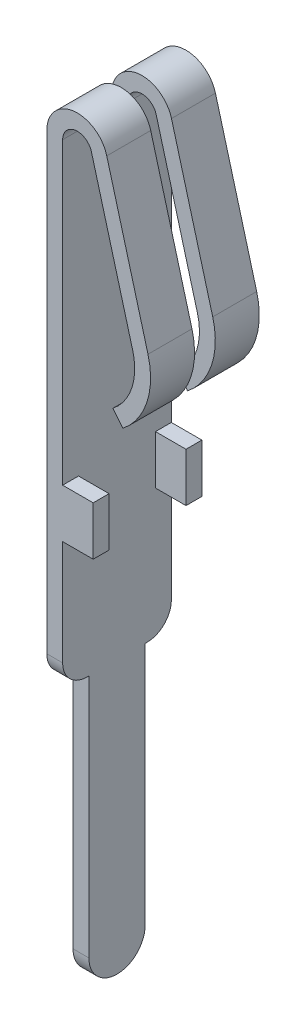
ISO-10303-21;
HEADER;
FILE_DESCRIPTION(('STEP AP214'),'2;1');
FILE_NAME('part.step','',(''),(''),'','','');
FILE_SCHEMA(('AUTOMOTIVE_DESIGN { 1 0 10303 214 1 1 1 1 }'));
ENDSEC;
DATA;
#1=APPLICATION_CONTEXT('core data for automotive mechanical design processes');
#2=APPLICATION_PROTOCOL_DEFINITION('international standard','automotive_design',2000,#1);
#3=PRODUCT_CONTEXT('',#1,'mechanical');
#4=PRODUCT('Part','Part','',(#3));
#5=PRODUCT_RELATED_PRODUCT_CATEGORY('part','',(#4));
#6=PRODUCT_DEFINITION_FORMATION('','',#4);
#7=PRODUCT_DEFINITION_CONTEXT('part definition',#1,'design');
#8=PRODUCT_DEFINITION('design','',#6,#7);
#9=PRODUCT_DEFINITION_SHAPE('','',#8);
#10=(LENGTH_UNIT() NAMED_UNIT(*) SI_UNIT(.MILLI.,.METRE.));
#11=(NAMED_UNIT(*) PLANE_ANGLE_UNIT() SI_UNIT($,.RADIAN.));
#12=(NAMED_UNIT(*) SI_UNIT($,.STERADIAN.) SOLID_ANGLE_UNIT());
#13=UNCERTAINTY_MEASURE_WITH_UNIT(LENGTH_MEASURE(1.E-05),#10,'distance_accuracy_value','');
#14=(GEOMETRIC_REPRESENTATION_CONTEXT(3) GLOBAL_UNCERTAINTY_ASSIGNED_CONTEXT((#13)) GLOBAL_UNIT_ASSIGNED_CONTEXT((#10,
#11,#12)) REPRESENTATION_CONTEXT('',''));
#15=CARTESIAN_POINT('',(0.,0.,0.));
#16=DIRECTION('',(0.,0.,1.));
#17=DIRECTION('',(1.,0.,0.));
#18=AXIS2_PLACEMENT_3D('',#15,#16,#17);
#19=CARTESIAN_POINT('',(-3.51558389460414,-2.6924,-0.6223));
#20=DIRECTION('',(0.,-1.,0.));
#21=DIRECTION('',(0.,0.,-1.));
#22=AXIS2_PLACEMENT_3D('',#19,#20,#21);
#23=PLANE('',#22);
#24=DIRECTION('',(1.,0.,0.));
#25=VECTOR('',#24,1.);
#26=CARTESIAN_POINT('',(-5.78345227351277,-2.6924,-0.5842));
#27=LINE('',#26,#25);
#28=CARTESIAN_POINT('',(0.,-2.6924,-0.5842));
#29=VERTEX_POINT('',#28);
#30=CARTESIAN_POINT('',(0.3302,-2.6924,-0.5842));
#31=VERTEX_POINT('',#30);
#32=EDGE_CURVE('E657',#29,#31,#27,.T.);
#33=ORIENTED_EDGE('',*,*,#32,.F.);
#34=DIRECTION('',(0.,0.,1.));
#35=VECTOR('',#34,1.);
#36=CARTESIAN_POINT('',(0.,-2.6924,-0.6223));
#37=LINE('',#36,#35);
#38=CARTESIAN_POINT('',(0.,-2.6924,-0.6223));
#39=VERTEX_POINT('',#38);
#40=EDGE_CURVE('E323',#39,#29,#37,.T.);
#41=ORIENTED_EDGE('',*,*,#40,.F.);
#42=DIRECTION('',(1.,0.,0.));
#43=VECTOR('',#42,1.);
#44=CARTESIAN_POINT('',(-3.51558389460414,-2.6924,-0.6223));
#45=LINE('',#44,#43);
#46=CARTESIAN_POINT('',(0.3302,-2.6924,-0.6223));
#47=VERTEX_POINT('',#46);
#48=EDGE_CURVE('E260',#39,#47,#45,.T.);
#49=ORIENTED_EDGE('',*,*,#48,.T.);
#50=DIRECTION('',(0.,0.,-1.));
#51=VECTOR('',#50,1.);
#52=CARTESIAN_POINT('',(0.3302,-2.6924,-0.6223));
#53=LINE('',#52,#51);
#54=EDGE_CURVE('E253',#31,#47,#53,.T.);
#55=ORIENTED_EDGE('',*,*,#54,.F.);
#56=EDGE_LOOP('',(#33,#41,#49,#55));
#57=FACE_BOUND('',#56,.T.);
#58=ADVANCED_FACE('F16',(#57),#23,.T.);
#59=CARTESIAN_POINT('',(0.,0.,1.1303));
#60=DIRECTION('',(0.,1.,0.));
#61=DIRECTION('',(0.,0.,1.));
#62=AXIS2_PLACEMENT_3D('',#59,#60,#61);
#63=PLANE('',#62);
#64=DIRECTION('',(0.,0.,1.));
#65=VECTOR('',#64,1.);
#66=CARTESIAN_POINT('',(0.3302,0.,1.1303));
#67=LINE('',#66,#65);
#68=CARTESIAN_POINT('',(0.3302,0.,-1.1303));
#69=VERTEX_POINT('',#68);
#70=CARTESIAN_POINT('',(0.3302,0.,-0.8001));
#71=VERTEX_POINT('',#70);
#72=EDGE_CURVE('E41',#69,#71,#67,.T.);
#73=ORIENTED_EDGE('',*,*,#72,.F.);
#74=DIRECTION('',(1.,0.,0.));
#75=VECTOR('',#74,1.);
#76=CARTESIAN_POINT('',(0.,0.,-1.1303));
#77=LINE('',#76,#75);
#78=CARTESIAN_POINT('',(0.9652,0.,-1.1303));
#79=VERTEX_POINT('',#78);
#80=EDGE_CURVE('E288',#69,#79,#77,.T.);
#81=ORIENTED_EDGE('',*,*,#80,.T.);
#82=DIRECTION('',(0.,0.,-1.));
#83=VECTOR('',#82,1.);
#84=CARTESIAN_POINT('',(0.9652,0.,-1.1303));
#85=LINE('',#84,#83);
#86=CARTESIAN_POINT('',(0.9652,0.,-0.8001));
#87=VERTEX_POINT('',#86);
#88=EDGE_CURVE('E300',#87,#79,#85,.T.);
#89=ORIENTED_EDGE('',*,*,#88,.F.);
#90=DIRECTION('',(-1.,0.,0.));
#91=VECTOR('',#90,1.);
#92=CARTESIAN_POINT('',(0.9652,0.,-0.8001));
#93=LINE('',#92,#91);
#94=EDGE_CURVE('E304',#87,#71,#93,.T.);
#95=ORIENTED_EDGE('',*,*,#94,.T.);
#96=EDGE_LOOP('',(#73,#81,#89,#95));
#97=FACE_BOUND('',#96,.T.);
#98=ADVANCED_FACE('F18',(#97),#63,.F.);
#99=CARTESIAN_POINT('',(0.3302,0.,0.8001));
#100=VERTEX_POINT('',#99);
#101=CARTESIAN_POINT('',(0.3302,0.,1.1303));
#102=VERTEX_POINT('',#101);
#103=EDGE_CURVE('E10',#100,#102,#67,.T.);
#104=ORIENTED_EDGE('',*,*,#103,.F.);
#105=DIRECTION('',(-1.,0.,0.));
#106=VECTOR('',#105,1.);
#107=CARTESIAN_POINT('',(0.9652,0.,0.8001));
#108=LINE('',#107,#106);
#109=CARTESIAN_POINT('',(0.9652,0.,0.8001));
#110=VERTEX_POINT('',#109);
#111=EDGE_CURVE('E285',#110,#100,#108,.T.);
#112=ORIENTED_EDGE('',*,*,#111,.F.);
#113=DIRECTION('',(0.,0.,-1.));
#114=VECTOR('',#113,1.);
#115=CARTESIAN_POINT('',(0.9652,0.,1.1303));
#116=LINE('',#115,#114);
#117=CARTESIAN_POINT('',(0.9652,0.,1.1303));
#118=VERTEX_POINT('',#117);
#119=EDGE_CURVE('E375',#118,#110,#116,.T.);
#120=ORIENTED_EDGE('',*,*,#119,.F.);
#121=DIRECTION('',(1.,0.,0.));
#122=VECTOR('',#121,1.);
#123=CARTESIAN_POINT('',(0.,0.,1.1303));
#124=LINE('',#123,#122);
#125=EDGE_CURVE('E279',#102,#118,#124,.T.);
#126=ORIENTED_EDGE('',*,*,#125,.F.);
#127=EDGE_LOOP('',(#104,#112,#120,#126));
#128=FACE_BOUND('',#127,.T.);
#129=ADVANCED_FACE('F514',(#128),#63,.F.);
#130=CARTESIAN_POINT('',(0.635,7.239,1.1303));
#131=DIRECTION('',(0.,0.,-1.));
#132=DIRECTION('',(-1.,0.,0.));
#133=AXIS2_PLACEMENT_3D('',#130,#131,#132);
#134=CYLINDRICAL_SURFACE('',#133,0.3048);
#135=CARTESIAN_POINT('',(0.635,7.239,-0.2159));
#136=DIRECTION('',(0.,0.,1.));
#137=DIRECTION('',(1.,0.,0.));
#138=AXIS2_PLACEMENT_3D('',#135,#136,#137);
#139=CIRCLE('',#138,0.3048);
#140=CARTESIAN_POINT('',(0.929056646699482,7.31921052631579,-0.2159));
#141=VERTEX_POINT('',#140);
#142=CARTESIAN_POINT('',(0.3302,7.239,-0.2159));
#143=VERTEX_POINT('',#142);
#144=EDGE_CURVE('E342',#141,#143,#139,.T.);
#145=ORIENTED_EDGE('',*,*,#144,.T.);
#146=DIRECTION('',(0.,0.,-1.));
#147=VECTOR('',#146,1.);
#148=CARTESIAN_POINT('',(0.3302,7.239,1.1303));
#149=LINE('',#148,#147);
#150=CARTESIAN_POINT('',(0.3302,7.239,-1.1303));
#151=VERTEX_POINT('',#150);
#152=EDGE_CURVE('E414',#143,#151,#149,.T.);
#153=ORIENTED_EDGE('',*,*,#152,.T.);
#154=CARTESIAN_POINT('',(0.635,7.239,-1.1303));
#155=DIRECTION('',(0.,0.,-1.));
#156=DIRECTION('',(-1.,0.,0.));
#157=AXIS2_PLACEMENT_3D('',#154,#155,#156);
#158=CIRCLE('',#157,0.3048);
#159=CARTESIAN_POINT('',(0.929056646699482,7.31921052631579,-1.1303));
#160=VERTEX_POINT('',#159);
#161=EDGE_CURVE('E461',#151,#160,#158,.T.);
#162=ORIENTED_EDGE('',*,*,#161,.T.);
#163=DIRECTION('',(0.,0.,-1.));
#164=VECTOR('',#163,1.);
#165=CARTESIAN_POINT('',(0.929056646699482,7.31921052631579,1.1303));
#166=LINE('',#165,#164);
#167=EDGE_CURVE('E418',#141,#160,#166,.T.);
#168=ORIENTED_EDGE('',*,*,#167,.F.);
#169=EDGE_LOOP('',(#145,#153,#162,#168));
#170=FACE_BOUND('',#169,.T.);
#171=ADVANCED_FACE('F479',(#170),#134,.F.);
#172=CARTESIAN_POINT('',(0.929056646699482,7.31921052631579,1.1303));
#173=DIRECTION('',(0.96475277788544,0.263157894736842,0.));
#174=DIRECTION('',(-0.263157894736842,0.96475277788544,0.));
#175=AXIS2_PLACEMENT_3D('',#172,#173,#174);
#176=PLANE('',#175);
#177=DIRECTION('',(0.263157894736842,-0.96475277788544,0.));
#178=VECTOR('',#177,1.);
#179=CARTESIAN_POINT('',(2.72293561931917,0.74274158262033,-0.2159));
#180=LINE('',#179,#178);
#181=CARTESIAN_POINT('',(1.78672186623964,4.17495789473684,-0.2159));
#182=VERTEX_POINT('',#181);
#183=EDGE_CURVE('E345',#141,#182,#180,.T.);
#184=ORIENTED_EDGE('',*,*,#183,.F.);
#185=ORIENTED_EDGE('',*,*,#167,.T.);
#186=DIRECTION('',(0.263157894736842,-0.96475277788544,0.));
#187=VECTOR('',#186,1.);
#188=CARTESIAN_POINT('',(0.929056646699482,7.31921052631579,-1.1303));
#189=LINE('',#188,#187);
#190=CARTESIAN_POINT('',(1.78672186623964,4.17495789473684,-1.1303));
#191=VERTEX_POINT('',#190);
#192=EDGE_CURVE('E459',#160,#191,#189,.T.);
#193=ORIENTED_EDGE('',*,*,#192,.T.);
#194=DIRECTION('',(0.,0.,-1.));
#195=VECTOR('',#194,1.);
#196=CARTESIAN_POINT('',(1.78672186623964,4.17495789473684,1.1303));
#197=LINE('',#196,#195);
#198=EDGE_CURVE('E422',#182,#191,#197,.T.);
#199=ORIENTED_EDGE('',*,*,#198,.F.);
#200=EDGE_LOOP('',(#184,#185,#193,#199));
#201=FACE_BOUND('',#200,.T.);
#202=ADVANCED_FACE('F478',(#201),#176,.F.);
#203=CARTESIAN_POINT('',(0.635,3.8608,1.1303));
#204=DIRECTION('',(0.,0.,-1.));
#205=DIRECTION('',(-1.,0.,0.));
#206=AXIS2_PLACEMENT_3D('',#203,#204,#205);
#207=CYLINDRICAL_SURFACE('',#206,1.1938);
#208=CARTESIAN_POINT('',(0.635,3.8608,-0.2159));
#209=DIRECTION('',(0.,0.,1.));
#210=DIRECTION('',(1.,0.,0.));
#211=AXIS2_PLACEMENT_3D('',#208,#209,#210);
#212=CIRCLE('',#211,1.1938);
#213=CARTESIAN_POINT('',(1.37706831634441,2.92565666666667,-0.2159));
#214=VERTEX_POINT('',#213);
#215=EDGE_CURVE('E347',#214,#182,#212,.T.);
#216=ORIENTED_EDGE('',*,*,#215,.T.);
#217=ORIENTED_EDGE('',*,*,#198,.T.);
#218=CARTESIAN_POINT('',(0.635,3.8608,-1.1303));
#219=DIRECTION('',(0.,0.,-1.));
#220=DIRECTION('',(-1.,0.,0.));
#221=AXIS2_PLACEMENT_3D('',#218,#219,#220);
#222=CIRCLE('',#221,1.1938);
#223=CARTESIAN_POINT('',(1.37706831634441,2.92565666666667,-1.1303));
#224=VERTEX_POINT('',#223);
#225=EDGE_CURVE('E456',#191,#224,#222,.T.);
#226=ORIENTED_EDGE('',*,*,#225,.T.);
#227=DIRECTION('',(0.,0.,-1.));
#228=VECTOR('',#227,1.);
#229=CARTESIAN_POINT('',(1.37706831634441,2.92565666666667,1.1303));
#230=LINE('',#229,#228);
#231=EDGE_CURVE('E426',#214,#224,#230,.T.);
#232=ORIENTED_EDGE('',*,*,#231,.F.);
#233=EDGE_LOOP('',(#216,#217,#226,#232));
#234=FACE_BOUND('',#233,.T.);
#235=ADVANCED_FACE('F568',(#234),#207,.F.);
#236=CARTESIAN_POINT('',(1.58232125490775,2.667,1.1303));
#237=DIRECTION('',(0.783333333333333,0.62160187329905,0.));
#238=DIRECTION('',(-0.62160187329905,0.783333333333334,0.));
#239=AXIS2_PLACEMENT_3D('',#236,#237,#238);
#240=PLANE('',#239);
#241=DIRECTION('',(0.621601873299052,-0.783333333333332,0.));
#242=VECTOR('',#241,1.);
#243=CARTESIAN_POINT('',(2.26954945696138,1.8009653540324,-0.2159));
#244=LINE('',#243,#242);
#245=CARTESIAN_POINT('',(1.58232125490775,2.667,-0.2159));
#246=VERTEX_POINT('',#245);
#247=EDGE_CURVE('E350',#214,#246,#244,.T.);
#248=ORIENTED_EDGE('',*,*,#247,.F.);
#249=ORIENTED_EDGE('',*,*,#231,.T.);
#250=DIRECTION('',(0.62160187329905,-0.783333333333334,0.));
#251=VECTOR('',#250,1.);
#252=CARTESIAN_POINT('',(1.58232125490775,2.667,-1.1303));
#253=LINE('',#252,#251);
#254=CARTESIAN_POINT('',(1.58232125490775,2.667,-1.1303));
#255=VERTEX_POINT('',#254);
#256=EDGE_CURVE('E453',#224,#255,#253,.T.);
#257=ORIENTED_EDGE('',*,*,#256,.T.);
#258=DIRECTION('',(0.,0.,-1.));
#259=VECTOR('',#258,1.);
#260=CARTESIAN_POINT('',(1.58232125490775,2.667,1.1303));
#261=LINE('',#260,#259);
#262=EDGE_CURVE('E430',#246,#255,#261,.T.);
#263=ORIENTED_EDGE('',*,*,#262,.F.);
#264=EDGE_LOOP('',(#248,#249,#257,#263));
#265=FACE_BOUND('',#264,.T.);
#266=ADVANCED_FACE('F557',(#265),#240,.F.);
#267=CARTESIAN_POINT('',(0.635,3.8608,1.1303));
#268=DIRECTION('',(0.,0.,-1.));
#269=DIRECTION('',(-1.,0.,0.));
#270=AXIS2_PLACEMENT_3D('',#267,#268,#269);
#271=CYLINDRICAL_SURFACE('',#270,1.524);
#272=CARTESIAN_POINT('',(0.635,3.8608,-0.2159));
#273=DIRECTION('',(0.,0.,1.));
#274=DIRECTION('',(1.,0.,0.));
#275=AXIS2_PLACEMENT_3D('',#272,#273,#274);
#276=CIRCLE('',#275,1.524);
#277=CARTESIAN_POINT('',(2.10528323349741,4.26185263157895,-0.2159));
#278=VERTEX_POINT('',#277);
#279=EDGE_CURVE('E352',#246,#278,#276,.T.);
#280=ORIENTED_EDGE('',*,*,#279,.F.);
#281=ORIENTED_EDGE('',*,*,#262,.T.);
#282=CARTESIAN_POINT('',(0.635,3.8608,-1.1303));
#283=DIRECTION('',(0.,0.,1.));
#284=DIRECTION('',(-1.,0.,0.));
#285=AXIS2_PLACEMENT_3D('',#282,#283,#284);
#286=CIRCLE('',#285,1.524);
#287=CARTESIAN_POINT('',(2.10528323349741,4.26185263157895,-1.1303));
#288=VERTEX_POINT('',#287);
#289=EDGE_CURVE('E450',#255,#288,#286,.T.);
#290=ORIENTED_EDGE('',*,*,#289,.T.);
#291=DIRECTION('',(0.,0.,-1.));
#292=VECTOR('',#291,1.);
#293=CARTESIAN_POINT('',(2.10528323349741,4.26185263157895,1.1303));
#294=LINE('',#293,#292);
#295=EDGE_CURVE('E434',#278,#288,#294,.T.);
#296=ORIENTED_EDGE('',*,*,#295,.F.);
#297=EDGE_LOOP('',(#280,#281,#290,#296));
#298=FACE_BOUND('',#297,.T.);
#299=ADVANCED_FACE('F564',(#298),#271,.T.);
#300=CARTESIAN_POINT('',(1.24761801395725,7.40610526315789,1.1303));
#301=DIRECTION('',(-0.96475277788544,-0.263157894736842,0.));
#302=DIRECTION('',(0.263157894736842,-0.96475277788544,0.));
#303=AXIS2_PLACEMENT_3D('',#300,#301,#302);
#304=PLANE('',#303);
#305=DIRECTION('',(-0.263157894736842,0.96475277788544,0.));
#306=VECTOR('',#305,1.);
#307=CARTESIAN_POINT('',(3.04149698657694,0.829636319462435,-0.2159));
#308=LINE('',#307,#306);
#309=CARTESIAN_POINT('',(1.24761801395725,7.40610526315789,-0.2159));
#310=VERTEX_POINT('',#309);
#311=EDGE_CURVE('E326',#278,#310,#308,.T.);
#312=ORIENTED_EDGE('',*,*,#311,.F.);
#313=ORIENTED_EDGE('',*,*,#295,.T.);
#314=DIRECTION('',(-0.263157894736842,0.96475277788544,0.));
#315=VECTOR('',#314,1.);
#316=CARTESIAN_POINT('',(1.24761801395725,7.40610526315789,-1.1303));
#317=LINE('',#316,#315);
#318=CARTESIAN_POINT('',(1.24761801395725,7.40610526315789,-1.1303));
#319=VERTEX_POINT('',#318);
#320=EDGE_CURVE('E447',#288,#319,#317,.T.);
#321=ORIENTED_EDGE('',*,*,#320,.T.);
#322=DIRECTION('',(0.,0.,-1.));
#323=VECTOR('',#322,1.);
#324=CARTESIAN_POINT('',(1.24761801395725,7.40610526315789,1.1303));
#325=LINE('',#324,#323);
#326=EDGE_CURVE('E438',#310,#319,#325,.T.);
#327=ORIENTED_EDGE('',*,*,#326,.F.);
#328=EDGE_LOOP('',(#312,#313,#321,#327));
#329=FACE_BOUND('',#328,.T.);
#330=ADVANCED_FACE('F629',(#329),#304,.F.);
#331=CARTESIAN_POINT('',(0.635,7.239,1.1303));
#332=DIRECTION('',(0.,0.,-1.));
#333=DIRECTION('',(-1.,0.,0.));
#334=AXIS2_PLACEMENT_3D('',#331,#332,#333);
#335=CYLINDRICAL_SURFACE('',#334,0.635);
#336=CARTESIAN_POINT('',(0.635,7.239,-0.2159));
#337=DIRECTION('',(0.,0.,1.));
#338=DIRECTION('',(1.,0.,0.));
#339=AXIS2_PLACEMENT_3D('',#336,#337,#338);
#340=CIRCLE('',#339,0.635);
#341=CARTESIAN_POINT('',(0.,7.239,-0.2159));
#342=VERTEX_POINT('',#341);
#343=EDGE_CURVE('E329',#310,#342,#340,.T.);
#344=ORIENTED_EDGE('',*,*,#343,.F.);
#345=ORIENTED_EDGE('',*,*,#326,.T.);
#346=CARTESIAN_POINT('',(0.635,7.239,-1.1303));
#347=DIRECTION('',(0.,0.,1.));
#348=DIRECTION('',(-1.,0.,0.));
#349=AXIS2_PLACEMENT_3D('',#346,#347,#348);
#350=CIRCLE('',#349,0.635);
#351=CARTESIAN_POINT('',(0.,7.239,-1.1303));
#352=VERTEX_POINT('',#351);
#353=EDGE_CURVE('E444',#319,#352,#350,.T.);
#354=ORIENTED_EDGE('',*,*,#353,.T.);
#355=DIRECTION('',(0.,0.,-1.));
#356=VECTOR('',#355,1.);
#357=CARTESIAN_POINT('',(0.,7.239,1.1303));
#358=LINE('',#357,#356);
#359=EDGE_CURVE('E406',#342,#352,#358,.T.);
#360=ORIENTED_EDGE('',*,*,#359,.F.);
#361=EDGE_LOOP('',(#344,#345,#354,#360));
#362=FACE_BOUND('',#361,.T.);
#363=ADVANCED_FACE('F627',(#362),#335,.T.);
#364=CARTESIAN_POINT('',(0.3302,0.,1.1303));
#365=DIRECTION('',(-1.,0.,0.));
#366=DIRECTION('',(0.,0.,1.));
#367=AXIS2_PLACEMENT_3D('',#364,#365,#366);
#368=PLANE('',#367);
#369=DIRECTION('',(0.,0.,1.));
#370=VECTOR('',#369,1.);
#371=CARTESIAN_POINT('',(0.3302,1.016,-1.1303));
#372=LINE('',#371,#370);
#373=CARTESIAN_POINT('',(0.3302,1.016,-1.1303));
#374=VERTEX_POINT('',#373);
#375=CARTESIAN_POINT('',(0.3302,1.016,-0.8001));
#376=VERTEX_POINT('',#375);
#377=EDGE_CURVE('E301',#374,#376,#372,.T.);
#378=ORIENTED_EDGE('',*,*,#377,.F.);
#379=DIRECTION('',(0.,1.,0.));
#380=VECTOR('',#379,1.);
#381=CARTESIAN_POINT('',(0.3302,0.,-1.1303));
#382=LINE('',#381,#380);
#383=EDGE_CURVE('E409',#374,#151,#382,.T.);
#384=ORIENTED_EDGE('',*,*,#383,.T.);
#385=ORIENTED_EDGE('',*,*,#152,.F.);
#386=DIRECTION('',(0.,0.,-1.));
#387=VECTOR('',#386,1.);
#388=CARTESIAN_POINT('',(0.3302,7.239,0.2159));
#389=LINE('',#388,#387);
#390=CARTESIAN_POINT('',(0.3302,7.239,0.2159));
#391=VERTEX_POINT('',#390);
#392=EDGE_CURVE('E354',#391,#143,#389,.T.);
#393=ORIENTED_EDGE('',*,*,#392,.F.);
#394=CARTESIAN_POINT('',(0.3302,7.239,1.1303));
#395=VERTEX_POINT('',#394);
#396=EDGE_CURVE('E25',#395,#391,#149,.T.);
#397=ORIENTED_EDGE('',*,*,#396,.F.);
#398=DIRECTION('',(0.,1.,0.));
#399=VECTOR('',#398,1.);
#400=CARTESIAN_POINT('',(0.3302,0.,1.1303));
#401=LINE('',#400,#399);
#402=CARTESIAN_POINT('',(0.3302,1.016,1.1303));
#403=VERTEX_POINT('',#402);
#404=EDGE_CURVE('E388',#403,#395,#401,.T.);
#405=ORIENTED_EDGE('',*,*,#404,.F.);
#406=DIRECTION('',(0.,0.,1.));
#407=VECTOR('',#406,1.);
#408=CARTESIAN_POINT('',(0.3302,1.016,1.1303));
#409=LINE('',#408,#407);
#410=CARTESIAN_POINT('',(0.3302,1.016,0.8001));
#411=VERTEX_POINT('',#410);
#412=EDGE_CURVE('E294',#411,#403,#409,.T.);
#413=ORIENTED_EDGE('',*,*,#412,.F.);
#414=DIRECTION('',(0.,1.,0.));
#415=VECTOR('',#414,1.);
#416=CARTESIAN_POINT('',(0.3302,0.,0.8001));
#417=LINE('',#416,#415);
#418=EDGE_CURVE('E292',#100,#411,#417,.T.);
#419=ORIENTED_EDGE('',*,*,#418,.F.);
#420=ORIENTED_EDGE('',*,*,#103,.T.);
#421=DIRECTION('',(0.,-1.,0.));
#422=VECTOR('',#421,1.);
#423=CARTESIAN_POINT('',(0.3302,0.,1.1303));
#424=LINE('',#423,#422);
#425=CARTESIAN_POINT('',(0.3302,-2.1844,1.1303));
#426=VERTEX_POINT('',#425);
#427=EDGE_CURVE('E268',#102,#426,#424,.T.);
#428=ORIENTED_EDGE('',*,*,#427,.T.);
#429=CARTESIAN_POINT('',(0.3302,-2.1844,0.6223));
#430=DIRECTION('',(1.,0.,0.));
#431=DIRECTION('',(0.,0.,-1.));
#432=AXIS2_PLACEMENT_3D('',#429,#430,#431);
#433=CIRCLE('',#432,0.508);
#434=CARTESIAN_POINT('',(0.3302,-2.6924,0.6223));
#435=VERTEX_POINT('',#434);
#436=EDGE_CURVE('E251',#426,#435,#433,.T.);
#437=ORIENTED_EDGE('',*,*,#436,.T.);
#438=CARTESIAN_POINT('',(0.3302,-2.6924,0.5842));
#439=VERTEX_POINT('',#438);
#440=EDGE_CURVE('E242',#435,#439,#53,.T.);
#441=ORIENTED_EDGE('',*,*,#440,.T.);
#442=DIRECTION('',(0.,-1.,0.));
#443=VECTOR('',#442,1.);
#444=CARTESIAN_POINT('',(0.3302,-2.6924,0.5842));
#445=LINE('',#444,#443);
#446=CARTESIAN_POINT('',(0.3302,-7.7724,0.584199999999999));
#447=VERTEX_POINT('',#446);
#448=EDGE_CURVE('E227',#439,#447,#445,.T.);
#449=ORIENTED_EDGE('',*,*,#448,.T.);
#450=CARTESIAN_POINT('',(0.3302,-7.7724,0.));
#451=DIRECTION('',(1.,0.,0.));
#452=DIRECTION('',(0.,0.,1.));
#453=AXIS2_PLACEMENT_3D('',#450,#451,#452);
#454=CIRCLE('',#453,0.5842);
#455=CARTESIAN_POINT('',(0.3302,-7.7724,-0.584200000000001));
#456=VERTEX_POINT('',#455);
#457=EDGE_CURVE('E235',#447,#456,#454,.T.);
#458=ORIENTED_EDGE('',*,*,#457,.T.);
#459=DIRECTION('',(0.,1.,0.));
#460=VECTOR('',#459,1.);
#461=CARTESIAN_POINT('',(0.3302,-2.6924,-0.5842));
#462=LINE('',#461,#460);
#463=EDGE_CURVE('E244',#456,#31,#462,.T.);
#464=ORIENTED_EDGE('',*,*,#463,.T.);
#465=ORIENTED_EDGE('',*,*,#54,.T.);
#466=CARTESIAN_POINT('',(0.3302,-2.1844,-0.6223));
#467=DIRECTION('',(1.,0.,0.));
#468=DIRECTION('',(0.,0.,1.));
#469=AXIS2_PLACEMENT_3D('',#466,#467,#468);
#470=CIRCLE('',#469,0.508);
#471=CARTESIAN_POINT('',(0.3302,-2.1844,-1.1303));
#472=VERTEX_POINT('',#471);
#473=EDGE_CURVE('E274',#47,#472,#470,.T.);
#474=ORIENTED_EDGE('',*,*,#473,.T.);
#475=DIRECTION('',(0.,1.,0.));
#476=VECTOR('',#475,1.);
#477=CARTESIAN_POINT('',(0.3302,0.,-1.1303));
#478=LINE('',#477,#476);
#479=EDGE_CURVE('E269',#472,#69,#478,.T.);
#480=ORIENTED_EDGE('',*,*,#479,.T.);
#481=ORIENTED_EDGE('',*,*,#72,.T.);
#482=DIRECTION('',(0.,-1.,0.));
#483=VECTOR('',#482,1.);
#484=CARTESIAN_POINT('',(0.3302,0.,-0.8001));
#485=LINE('',#484,#483);
#486=EDGE_CURVE('E298',#376,#71,#485,.T.);
#487=ORIENTED_EDGE('',*,*,#486,.F.);
#488=EDGE_LOOP('',(#378,#384,#385,#393,#397,#405,#413,#419,#420,#428,#437,#441,#449,#458,#464,
#465,#474,#480,#481,#487));
#489=FACE_BOUND('',#488,.T.);
#490=ADVANCED_FACE('F248',(#489),#368,.F.);
#491=ORIENTED_EDGE('',*,*,#396,.T.);
#492=CARTESIAN_POINT('',(0.635,7.239,0.2159));
#493=DIRECTION('',(0.,0.,1.));
#494=DIRECTION('',(1.,0.,0.));
#495=AXIS2_PLACEMENT_3D('',#492,#493,#494);
#496=CIRCLE('',#495,0.3048);
#497=CARTESIAN_POINT('',(0.929056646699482,7.31921052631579,0.2159));
#498=VERTEX_POINT('',#497);
#499=EDGE_CURVE('E495',#498,#391,#496,.T.);
#500=ORIENTED_EDGE('',*,*,#499,.F.);
#501=CARTESIAN_POINT('',(0.929056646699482,7.31921052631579,1.1303));
#502=VERTEX_POINT('',#501);
#503=EDGE_CURVE('E415',#502,#498,#166,.T.);
#504=ORIENTED_EDGE('',*,*,#503,.F.);
#505=CARTESIAN_POINT('',(0.635,7.239,1.1303));
#506=DIRECTION('',(0.,0.,-1.));
#507=DIRECTION('',(-1.,0.,0.));
#508=AXIS2_PLACEMENT_3D('',#505,#506,#507);
#509=CIRCLE('',#508,0.3048);
#510=EDGE_CURVE('E390',#395,#502,#509,.T.);
#511=ORIENTED_EDGE('',*,*,#510,.F.);
#512=EDGE_LOOP('',(#491,#500,#504,#511));
#513=FACE_BOUND('',#512,.T.);
#514=ADVANCED_FACE('F493',(#513),#134,.F.);
#515=ORIENTED_EDGE('',*,*,#503,.T.);
#516=DIRECTION('',(0.263157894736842,-0.96475277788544,0.));
#517=VECTOR('',#516,1.);
#518=CARTESIAN_POINT('',(2.72293561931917,0.74274158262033,0.2159));
#519=LINE('',#518,#517);
#520=CARTESIAN_POINT('',(1.78672186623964,4.17495789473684,0.2159));
#521=VERTEX_POINT('',#520);
#522=EDGE_CURVE('E534',#498,#521,#519,.T.);
#523=ORIENTED_EDGE('',*,*,#522,.T.);
#524=CARTESIAN_POINT('',(1.78672186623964,4.17495789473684,1.1303));
#525=VERTEX_POINT('',#524);
#526=EDGE_CURVE('E419',#525,#521,#197,.T.);
#527=ORIENTED_EDGE('',*,*,#526,.F.);
#528=DIRECTION('',(0.263157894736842,-0.96475277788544,0.));
#529=VECTOR('',#528,1.);
#530=CARTESIAN_POINT('',(0.929056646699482,7.31921052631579,1.1303));
#531=LINE('',#530,#529);
#532=EDGE_CURVE('E392',#502,#525,#531,.T.);
#533=ORIENTED_EDGE('',*,*,#532,.F.);
#534=EDGE_LOOP('',(#515,#523,#527,#533));
#535=FACE_BOUND('',#534,.T.);
#536=ADVANCED_FACE('F565',(#535),#176,.F.);
#537=ORIENTED_EDGE('',*,*,#526,.T.);
#538=CARTESIAN_POINT('',(0.635,3.8608,0.2159));
#539=DIRECTION('',(0.,0.,1.));
#540=DIRECTION('',(1.,0.,0.));
#541=AXIS2_PLACEMENT_3D('',#538,#539,#540);
#542=CIRCLE('',#541,1.1938);
#543=CARTESIAN_POINT('',(1.37706831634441,2.92565666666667,0.2159));
#544=VERTEX_POINT('',#543);
#545=EDGE_CURVE('E537',#544,#521,#542,.T.);
#546=ORIENTED_EDGE('',*,*,#545,.F.);
#547=CARTESIAN_POINT('',(1.37706831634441,2.92565666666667,1.1303));
#548=VERTEX_POINT('',#547);
#549=EDGE_CURVE('E423',#548,#544,#230,.T.);
#550=ORIENTED_EDGE('',*,*,#549,.F.);
#551=CARTESIAN_POINT('',(0.635,3.8608,1.1303));
#552=DIRECTION('',(0.,0.,-1.));
#553=DIRECTION('',(-1.,0.,0.));
#554=AXIS2_PLACEMENT_3D('',#551,#552,#553);
#555=CIRCLE('',#554,1.1938);
#556=EDGE_CURVE('E394',#525,#548,#555,.T.);
#557=ORIENTED_EDGE('',*,*,#556,.F.);
#558=EDGE_LOOP('',(#537,#546,#550,#557));
#559=FACE_BOUND('',#558,.T.);
#560=ADVANCED_FACE('F555',(#559),#207,.F.);
#561=ORIENTED_EDGE('',*,*,#549,.T.);
#562=DIRECTION('',(0.621601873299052,-0.783333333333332,0.));
#563=VECTOR('',#562,1.);
#564=CARTESIAN_POINT('',(2.26954945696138,1.8009653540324,0.2159));
#565=LINE('',#564,#563);
#566=CARTESIAN_POINT('',(1.58232125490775,2.667,0.2159));
#567=VERTEX_POINT('',#566);
#568=EDGE_CURVE('E538',#544,#567,#565,.T.);
#569=ORIENTED_EDGE('',*,*,#568,.T.);
#570=CARTESIAN_POINT('',(1.58232125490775,2.667,1.1303));
#571=VERTEX_POINT('',#570);
#572=EDGE_CURVE('E427',#571,#567,#261,.T.);
#573=ORIENTED_EDGE('',*,*,#572,.F.);
#574=DIRECTION('',(0.62160187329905,-0.783333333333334,0.));
#575=VECTOR('',#574,1.);
#576=CARTESIAN_POINT('',(1.58232125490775,2.667,1.1303));
#577=LINE('',#576,#575);
#578=EDGE_CURVE('E396',#548,#571,#577,.T.);
#579=ORIENTED_EDGE('',*,*,#578,.F.);
#580=EDGE_LOOP('',(#561,#569,#573,#579));
#581=FACE_BOUND('',#580,.T.);
#582=ADVANCED_FACE('F553',(#581),#240,.F.);
#583=ORIENTED_EDGE('',*,*,#572,.T.);
#584=CARTESIAN_POINT('',(0.635,3.8608,0.2159));
#585=DIRECTION('',(0.,0.,1.));
#586=DIRECTION('',(1.,0.,0.));
#587=AXIS2_PLACEMENT_3D('',#584,#585,#586);
#588=CIRCLE('',#587,1.524);
#589=CARTESIAN_POINT('',(2.10528323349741,4.26185263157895,0.2159));
#590=VERTEX_POINT('',#589);
#591=EDGE_CURVE('E338',#567,#590,#588,.T.);
#592=ORIENTED_EDGE('',*,*,#591,.T.);
#593=CARTESIAN_POINT('',(2.10528323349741,4.26185263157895,1.1303));
#594=VERTEX_POINT('',#593);
#595=EDGE_CURVE('E431',#594,#590,#294,.T.);
#596=ORIENTED_EDGE('',*,*,#595,.F.);
#597=CARTESIAN_POINT('',(0.635,3.8608,1.1303));
#598=DIRECTION('',(0.,0.,1.));
#599=DIRECTION('',(-1.,0.,0.));
#600=AXIS2_PLACEMENT_3D('',#597,#598,#599);
#601=CIRCLE('',#600,1.524);
#602=EDGE_CURVE('E398',#571,#594,#601,.T.);
#603=ORIENTED_EDGE('',*,*,#602,.F.);
#604=EDGE_LOOP('',(#583,#592,#596,#603));
#605=FACE_BOUND('',#604,.T.);
#606=ADVANCED_FACE('F545',(#605),#271,.T.);
#607=ORIENTED_EDGE('',*,*,#595,.T.);
#608=DIRECTION('',(-0.263157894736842,0.96475277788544,0.));
#609=VECTOR('',#608,1.);
#610=CARTESIAN_POINT('',(3.04149698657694,0.829636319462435,0.2159));
#611=LINE('',#610,#609);
#612=CARTESIAN_POINT('',(1.24761801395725,7.40610526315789,0.2159));
#613=VERTEX_POINT('',#612);
#614=EDGE_CURVE('E270',#590,#613,#611,.T.);
#615=ORIENTED_EDGE('',*,*,#614,.T.);
#616=CARTESIAN_POINT('',(1.24761801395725,7.40610526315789,1.1303));
#617=VERTEX_POINT('',#616);
#618=EDGE_CURVE('E435',#617,#613,#325,.T.);
#619=ORIENTED_EDGE('',*,*,#618,.F.);
#620=DIRECTION('',(-0.263157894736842,0.96475277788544,0.));
#621=VECTOR('',#620,1.);
#622=CARTESIAN_POINT('',(1.24761801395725,7.40610526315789,1.1303));
#623=LINE('',#622,#621);
#624=EDGE_CURVE('E400',#594,#617,#623,.T.);
#625=ORIENTED_EDGE('',*,*,#624,.F.);
#626=EDGE_LOOP('',(#607,#615,#619,#625));
#627=FACE_BOUND('',#626,.T.);
#628=ADVANCED_FACE('F549',(#627),#304,.F.);
#629=ORIENTED_EDGE('',*,*,#618,.T.);
#630=CARTESIAN_POINT('',(0.635,7.239,0.2159));
#631=DIRECTION('',(0.,0.,1.));
#632=DIRECTION('',(1.,0.,0.));
#633=AXIS2_PLACEMENT_3D('',#630,#631,#632);
#634=CIRCLE('',#633,0.635);
#635=CARTESIAN_POINT('',(0.,7.239,0.2159));
#636=VERTEX_POINT('',#635);
#637=EDGE_CURVE('E527',#613,#636,#634,.T.);
#638=ORIENTED_EDGE('',*,*,#637,.T.);
#639=CARTESIAN_POINT('',(0.,7.239,1.1303));
#640=VERTEX_POINT('',#639);
#641=EDGE_CURVE('E439',#640,#636,#358,.T.);
#642=ORIENTED_EDGE('',*,*,#641,.F.);
#643=CARTESIAN_POINT('',(0.635,7.239,1.1303));
#644=DIRECTION('',(0.,0.,1.));
#645=DIRECTION('',(-1.,0.,0.));
#646=AXIS2_PLACEMENT_3D('',#643,#644,#645);
#647=CIRCLE('',#646,0.635);
#648=EDGE_CURVE('E402',#617,#640,#647,.T.);
#649=ORIENTED_EDGE('',*,*,#648,.F.);
#650=EDGE_LOOP('',(#629,#638,#642,#649));
#651=FACE_BOUND('',#650,.T.);
#652=ADVANCED_FACE('F526',(#651),#335,.T.);
#653=CARTESIAN_POINT('',(0.,0.,1.1303));
#654=DIRECTION('',(1.,0.,0.));
#655=DIRECTION('',(0.,0.,-1.));
#656=AXIS2_PLACEMENT_3D('',#653,#654,#655);
#657=PLANE('',#656);
#658=DIRECTION('',(0.,-1.,0.));
#659=VECTOR('',#658,1.);
#660=CARTESIAN_POINT('',(0.,0.,-1.1303));
#661=LINE('',#660,#659);
#662=CARTESIAN_POINT('',(0.,-2.1844,-1.1303));
#663=VERTEX_POINT('',#662);
#664=EDGE_CURVE('E442',#352,#663,#661,.T.);
#665=ORIENTED_EDGE('',*,*,#664,.T.);
#666=CARTESIAN_POINT('',(0.,-2.1844,-0.6223));
#667=DIRECTION('',(1.,0.,0.));
#668=DIRECTION('',(0.,0.,-1.));
#669=AXIS2_PLACEMENT_3D('',#666,#667,#668);
#670=CIRCLE('',#669,0.508);
#671=EDGE_CURVE('E325',#663,#39,#670,.F.);
#672=ORIENTED_EDGE('',*,*,#671,.T.);
#673=ORIENTED_EDGE('',*,*,#40,.T.);
#674=DIRECTION('',(0.,-1.,0.));
#675=VECTOR('',#674,1.);
#676=CARTESIAN_POINT('',(0.,-2.6924,-0.5842));
#677=LINE('',#676,#675);
#678=CARTESIAN_POINT('',(0.,-7.7724,-0.584200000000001));
#679=VERTEX_POINT('',#678);
#680=EDGE_CURVE('E314',#29,#679,#677,.T.);
#681=ORIENTED_EDGE('',*,*,#680,.T.);
#682=CARTESIAN_POINT('',(0.,-7.7724,0.));
#683=DIRECTION('',(1.,0.,0.));
#684=DIRECTION('',(0.,0.,-1.));
#685=AXIS2_PLACEMENT_3D('',#682,#683,#684);
#686=CIRCLE('',#685,0.5842);
#687=CARTESIAN_POINT('',(0.,-7.7724,0.584199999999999));
#688=VERTEX_POINT('',#687);
#689=EDGE_CURVE('E317',#679,#688,#686,.F.);
#690=ORIENTED_EDGE('',*,*,#689,.T.);
#691=DIRECTION('',(0.,1.,0.));
#692=VECTOR('',#691,1.);
#693=CARTESIAN_POINT('',(0.,-2.6924,0.5842));
#694=LINE('',#693,#692);
#695=CARTESIAN_POINT('',(0.,-2.6924,0.5842));
#696=VERTEX_POINT('',#695);
#697=EDGE_CURVE('E312',#688,#696,#694,.T.);
#698=ORIENTED_EDGE('',*,*,#697,.T.);
#699=CARTESIAN_POINT('',(0.,-2.6924,0.6223));
#700=VERTEX_POINT('',#699);
#701=EDGE_CURVE('E243',#696,#700,#37,.T.);
#702=ORIENTED_EDGE('',*,*,#701,.T.);
#703=CARTESIAN_POINT('',(0.,-2.1844,0.6223));
#704=DIRECTION('',(1.,0.,0.));
#705=DIRECTION('',(0.,0.,-1.));
#706=AXIS2_PLACEMENT_3D('',#703,#704,#705);
#707=CIRCLE('',#706,0.508);
#708=CARTESIAN_POINT('',(0.,-2.1844,1.1303));
#709=VERTEX_POINT('',#708);
#710=EDGE_CURVE('E263',#700,#709,#707,.F.);
#711=ORIENTED_EDGE('',*,*,#710,.T.);
#712=DIRECTION('',(0.,-1.,0.));
#713=VECTOR('',#712,1.);
#714=CARTESIAN_POINT('',(0.,0.,1.1303));
#715=LINE('',#714,#713);
#716=EDGE_CURVE('E404',#640,#709,#715,.T.);
#717=ORIENTED_EDGE('',*,*,#716,.F.);
#718=ORIENTED_EDGE('',*,*,#641,.T.);
#719=DIRECTION('',(0.,0.,-1.));
#720=VECTOR('',#719,1.);
#721=CARTESIAN_POINT('',(0.,7.239,0.2159));
#722=LINE('',#721,#720);
#723=EDGE_CURVE('E356',#636,#342,#722,.T.);
#724=ORIENTED_EDGE('',*,*,#723,.T.);
#725=ORIENTED_EDGE('',*,*,#359,.T.);
#726=EDGE_LOOP('',(#665,#672,#673,#681,#690,#698,#702,#711,#717,#718,#724,#725));
#727=FACE_BOUND('',#726,.T.);
#728=ADVANCED_FACE('F521',(#727),#657,.F.);
#729=CARTESIAN_POINT('',(0.635,7.239,1.1303));
#730=DIRECTION('',(0.,0.,-1.));
#731=DIRECTION('',(-1.,0.,0.));
#732=AXIS2_PLACEMENT_3D('',#729,#730,#731);
#733=PLANE('',#732);
#734=ORIENTED_EDGE('',*,*,#716,.T.);
#735=DIRECTION('',(1.,0.,0.));
#736=VECTOR('',#735,1.);
#737=CARTESIAN_POINT('',(-3.51558389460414,-2.1844,1.1303));
#738=LINE('',#737,#736);
#739=EDGE_CURVE('E255',#709,#426,#738,.T.);
#740=ORIENTED_EDGE('',*,*,#739,.T.);
#741=ORIENTED_EDGE('',*,*,#427,.F.);
#742=ORIENTED_EDGE('',*,*,#125,.T.);
#743=DIRECTION('',(0.,-1.,0.));
#744=VECTOR('',#743,1.);
#745=CARTESIAN_POINT('',(0.9652,0.,1.1303));
#746=LINE('',#745,#744);
#747=CARTESIAN_POINT('',(0.9652,1.016,1.1303));
#748=VERTEX_POINT('',#747);
#749=EDGE_CURVE('E372',#748,#118,#746,.T.);
#750=ORIENTED_EDGE('',*,*,#749,.F.);
#751=DIRECTION('',(-1.,0.,0.));
#752=VECTOR('',#751,1.);
#753=CARTESIAN_POINT('',(0.9652,1.016,1.1303));
#754=LINE('',#753,#752);
#755=EDGE_CURVE('E381',#748,#403,#754,.T.);
#756=ORIENTED_EDGE('',*,*,#755,.T.);
#757=ORIENTED_EDGE('',*,*,#404,.T.);
#758=ORIENTED_EDGE('',*,*,#510,.T.);
#759=ORIENTED_EDGE('',*,*,#532,.T.);
#760=ORIENTED_EDGE('',*,*,#556,.T.);
#761=ORIENTED_EDGE('',*,*,#578,.T.);
#762=ORIENTED_EDGE('',*,*,#602,.T.);
#763=ORIENTED_EDGE('',*,*,#624,.T.);
#764=ORIENTED_EDGE('',*,*,#648,.T.);
#765=EDGE_LOOP('',(#734,#740,#741,#742,#750,#756,#757,#758,#759,#760,#761,#762,#763,#764));
#766=FACE_BOUND('',#765,.T.);
#767=ADVANCED_FACE('F498',(#766),#733,.F.);
#768=CARTESIAN_POINT('',(0.635,7.239,-1.1303));
#769=DIRECTION('',(0.,0.,-1.));
#770=DIRECTION('',(-1.,0.,0.));
#771=AXIS2_PLACEMENT_3D('',#768,#769,#770);
#772=PLANE('',#771);
#773=ORIENTED_EDGE('',*,*,#80,.F.);
#774=ORIENTED_EDGE('',*,*,#479,.F.);
#775=DIRECTION('',(1.,0.,0.));
#776=VECTOR('',#775,1.);
#777=CARTESIAN_POINT('',(-3.51558389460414,-2.1844,-1.1303));
#778=LINE('',#777,#776);
#779=EDGE_CURVE('E252',#663,#472,#778,.T.);
#780=ORIENTED_EDGE('',*,*,#779,.F.);
#781=ORIENTED_EDGE('',*,*,#664,.F.);
#782=ORIENTED_EDGE('',*,*,#353,.F.);
#783=ORIENTED_EDGE('',*,*,#320,.F.);
#784=ORIENTED_EDGE('',*,*,#289,.F.);
#785=ORIENTED_EDGE('',*,*,#256,.F.);
#786=ORIENTED_EDGE('',*,*,#225,.F.);
#787=ORIENTED_EDGE('',*,*,#192,.F.);
#788=ORIENTED_EDGE('',*,*,#161,.F.);
#789=ORIENTED_EDGE('',*,*,#383,.F.);
#790=DIRECTION('',(-1.,0.,0.));
#791=VECTOR('',#790,1.);
#792=CARTESIAN_POINT('',(0.9652,1.016,-1.1303));
#793=LINE('',#792,#791);
#794=CARTESIAN_POINT('',(0.9652,1.016,-1.1303));
#795=VERTEX_POINT('',#794);
#796=EDGE_CURVE('E295',#795,#374,#793,.T.);
#797=ORIENTED_EDGE('',*,*,#796,.F.);
#798=DIRECTION('',(0.,1.,0.));
#799=VECTOR('',#798,1.);
#800=CARTESIAN_POINT('',(0.9652,0.,-1.1303));
#801=LINE('',#800,#799);
#802=EDGE_CURVE('E361',#79,#795,#801,.T.);
#803=ORIENTED_EDGE('',*,*,#802,.F.);
#804=EDGE_LOOP('',(#773,#774,#780,#781,#782,#783,#784,#785,#786,#787,#788,#789,#797,#803));
#805=FACE_BOUND('',#804,.T.);
#806=ADVANCED_FACE('F472',(#805),#772,.T.);
#807=CARTESIAN_POINT('',(0.9652,0.,0.8001));
#808=DIRECTION('',(0.,0.,1.));
#809=DIRECTION('',(1.,0.,0.));
#810=AXIS2_PLACEMENT_3D('',#807,#808,#809);
#811=PLANE('',#810);
#812=ORIENTED_EDGE('',*,*,#418,.T.);
#813=DIRECTION('',(-1.,0.,0.));
#814=VECTOR('',#813,1.);
#815=CARTESIAN_POINT('',(0.9652,1.016,0.8001));
#816=LINE('',#815,#814);
#817=CARTESIAN_POINT('',(0.9652,1.016,0.8001));
#818=VERTEX_POINT('',#817);
#819=EDGE_CURVE('E289',#818,#411,#816,.T.);
#820=ORIENTED_EDGE('',*,*,#819,.F.);
#821=DIRECTION('',(0.,1.,0.));
#822=VECTOR('',#821,1.);
#823=CARTESIAN_POINT('',(0.9652,0.,0.8001));
#824=LINE('',#823,#822);
#825=EDGE_CURVE('E377',#110,#818,#824,.T.);
#826=ORIENTED_EDGE('',*,*,#825,.F.);
#827=ORIENTED_EDGE('',*,*,#111,.T.);
#828=EDGE_LOOP('',(#812,#820,#826,#827));
#829=FACE_BOUND('',#828,.T.);
#830=ADVANCED_FACE('F510',(#829),#811,.F.);
#831=CARTESIAN_POINT('',(0.9652,1.016,1.1303));
#832=DIRECTION('',(0.,-1.,0.));
#833=DIRECTION('',(0.,0.,-1.));
#834=AXIS2_PLACEMENT_3D('',#831,#832,#833);
#835=PLANE('',#834);
#836=ORIENTED_EDGE('',*,*,#412,.T.);
#837=ORIENTED_EDGE('',*,*,#755,.F.);
#838=DIRECTION('',(0.,0.,1.));
#839=VECTOR('',#838,1.);
#840=CARTESIAN_POINT('',(0.9652,1.016,1.1303));
#841=LINE('',#840,#839);
#842=EDGE_CURVE('E379',#818,#748,#841,.T.);
#843=ORIENTED_EDGE('',*,*,#842,.F.);
#844=ORIENTED_EDGE('',*,*,#819,.T.);
#845=EDGE_LOOP('',(#836,#837,#843,#844));
#846=FACE_BOUND('',#845,.T.);
#847=ADVANCED_FACE('F505',(#846),#835,.F.);
#848=CARTESIAN_POINT('',(0.9652,1.016,1.1303));
#849=DIRECTION('',(-1.,0.,0.));
#850=DIRECTION('',(0.,0.,1.));
#851=AXIS2_PLACEMENT_3D('',#848,#849,#850);
#852=PLANE('',#851);
#853=ORIENTED_EDGE('',*,*,#749,.T.);
#854=ORIENTED_EDGE('',*,*,#119,.T.);
#855=ORIENTED_EDGE('',*,*,#825,.T.);
#856=ORIENTED_EDGE('',*,*,#842,.T.);
#857=EDGE_LOOP('',(#853,#854,#855,#856));
#858=FACE_BOUND('',#857,.T.);
#859=ADVANCED_FACE('F610',(#858),#852,.F.);
#860=CARTESIAN_POINT('',(0.9652,1.016,-1.1303));
#861=DIRECTION('',(0.,-1.,0.));
#862=DIRECTION('',(0.,0.,-1.));
#863=AXIS2_PLACEMENT_3D('',#860,#861,#862);
#864=PLANE('',#863);
#865=ORIENTED_EDGE('',*,*,#377,.T.);
#866=DIRECTION('',(-1.,0.,0.));
#867=VECTOR('',#866,1.);
#868=CARTESIAN_POINT('',(0.9652,1.016,-0.8001));
#869=LINE('',#868,#867);
#870=CARTESIAN_POINT('',(0.9652,1.016,-0.8001));
#871=VERTEX_POINT('',#870);
#872=EDGE_CURVE('E306',#871,#376,#869,.T.);
#873=ORIENTED_EDGE('',*,*,#872,.F.);
#874=DIRECTION('',(0.,0.,1.));
#875=VECTOR('',#874,1.);
#876=CARTESIAN_POINT('',(0.9652,1.016,-1.1303));
#877=LINE('',#876,#875);
#878=EDGE_CURVE('E363',#795,#871,#877,.T.);
#879=ORIENTED_EDGE('',*,*,#878,.F.);
#880=ORIENTED_EDGE('',*,*,#796,.T.);
#881=EDGE_LOOP('',(#865,#873,#879,#880));
#882=FACE_BOUND('',#881,.T.);
#883=ADVANCED_FACE('F606',(#882),#864,.F.);
#884=CARTESIAN_POINT('',(0.9652,0.,-0.8001));
#885=DIRECTION('',(0.,0.,-1.));
#886=DIRECTION('',(-1.,0.,0.));
#887=AXIS2_PLACEMENT_3D('',#884,#885,#886);
#888=PLANE('',#887);
#889=ORIENTED_EDGE('',*,*,#486,.T.);
#890=ORIENTED_EDGE('',*,*,#94,.F.);
#891=DIRECTION('',(0.,-1.,0.));
#892=VECTOR('',#891,1.);
#893=CARTESIAN_POINT('',(0.9652,0.,-0.8001));
#894=LINE('',#893,#892);
#895=EDGE_CURVE('E307',#871,#87,#894,.T.);
#896=ORIENTED_EDGE('',*,*,#895,.F.);
#897=ORIENTED_EDGE('',*,*,#872,.T.);
#898=EDGE_LOOP('',(#889,#890,#896,#897));
#899=FACE_BOUND('',#898,.T.);
#900=ADVANCED_FACE('F602',(#899),#888,.F.);
#901=CARTESIAN_POINT('',(0.9652,0.,-0.8001));
#902=DIRECTION('',(-1.,0.,0.));
#903=DIRECTION('',(0.,0.,1.));
#904=AXIS2_PLACEMENT_3D('',#901,#902,#903);
#905=PLANE('',#904);
#906=ORIENTED_EDGE('',*,*,#88,.T.);
#907=ORIENTED_EDGE('',*,*,#802,.T.);
#908=ORIENTED_EDGE('',*,*,#878,.T.);
#909=ORIENTED_EDGE('',*,*,#895,.T.);
#910=EDGE_LOOP('',(#906,#907,#908,#909));
#911=FACE_BOUND('',#910,.T.);
#912=ADVANCED_FACE('F599',(#911),#905,.F.);
#913=CARTESIAN_POINT('',(0.,7.239,0.2159));
#914=DIRECTION('',(0.,-1.,0.));
#915=DIRECTION('',(0.,0.,-1.));
#916=AXIS2_PLACEMENT_3D('',#913,#914,#915);
#917=PLANE('',#916);
#918=DIRECTION('',(-1.,0.,0.));
#919=VECTOR('',#918,1.);
#920=CARTESIAN_POINT('',(0.,7.239,-0.2159));
#921=LINE('',#920,#919);
#922=EDGE_CURVE('E335',#143,#342,#921,.T.);
#923=ORIENTED_EDGE('',*,*,#922,.T.);
#924=ORIENTED_EDGE('',*,*,#723,.F.);
#925=DIRECTION('',(-1.,0.,0.));
#926=VECTOR('',#925,1.);
#927=CARTESIAN_POINT('',(0.,7.239,0.2159));
#928=LINE('',#927,#926);
#929=EDGE_CURVE('E486',#391,#636,#928,.T.);
#930=ORIENTED_EDGE('',*,*,#929,.F.);
#931=ORIENTED_EDGE('',*,*,#392,.T.);
#932=EDGE_LOOP('',(#923,#924,#930,#931));
#933=FACE_BOUND('',#932,.T.);
#934=ADVANCED_FACE('F484',(#933),#917,.F.);
#935=CARTESIAN_POINT('',(0.,0.,0.2159));
#936=DIRECTION('',(0.,0.,1.));
#937=DIRECTION('',(1.,0.,0.));
#938=AXIS2_PLACEMENT_3D('',#935,#936,#937);
#939=PLANE('',#938);
#940=ORIENTED_EDGE('',*,*,#614,.F.);
#941=ORIENTED_EDGE('',*,*,#591,.F.);
#942=ORIENTED_EDGE('',*,*,#568,.F.);
#943=ORIENTED_EDGE('',*,*,#545,.T.);
#944=ORIENTED_EDGE('',*,*,#522,.F.);
#945=ORIENTED_EDGE('',*,*,#499,.T.);
#946=ORIENTED_EDGE('',*,*,#929,.T.);
#947=ORIENTED_EDGE('',*,*,#637,.F.);
#948=EDGE_LOOP('',(#940,#941,#942,#943,#944,#945,#946,#947));
#949=FACE_BOUND('',#948,.T.);
#950=ADVANCED_FACE('F592',(#949),#939,.F.);
#951=CARTESIAN_POINT('',(0.,0.,-0.2159));
#952=DIRECTION('',(0.,0.,1.));
#953=DIRECTION('',(1.,0.,0.));
#954=AXIS2_PLACEMENT_3D('',#951,#952,#953);
#955=PLANE('',#954);
#956=ORIENTED_EDGE('',*,*,#311,.T.);
#957=ORIENTED_EDGE('',*,*,#343,.T.);
#958=ORIENTED_EDGE('',*,*,#922,.F.);
#959=ORIENTED_EDGE('',*,*,#144,.F.);
#960=ORIENTED_EDGE('',*,*,#183,.T.);
#961=ORIENTED_EDGE('',*,*,#215,.F.);
#962=ORIENTED_EDGE('',*,*,#247,.T.);
#963=ORIENTED_EDGE('',*,*,#279,.T.);
#964=EDGE_LOOP('',(#956,#957,#958,#959,#960,#961,#962,#963));
#965=FACE_BOUND('',#964,.T.);
#966=ADVANCED_FACE('F481',(#965),#955,.T.);
#967=CARTESIAN_POINT('',(-3.51558389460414,-2.1844,-0.6223));
#968=DIRECTION('',(1.,0.,0.));
#969=DIRECTION('',(0.,0.,-1.));
#970=AXIS2_PLACEMENT_3D('',#967,#968,#969);
#971=CYLINDRICAL_SURFACE('',#970,0.508);
#972=ORIENTED_EDGE('',*,*,#671,.F.);
#973=ORIENTED_EDGE('',*,*,#779,.T.);
#974=ORIENTED_EDGE('',*,*,#473,.F.);
#975=ORIENTED_EDGE('',*,*,#48,.F.);
#976=EDGE_LOOP('',(#972,#973,#974,#975));
#977=FACE_BOUND('',#976,.T.);
#978=ADVANCED_FACE('F581',(#977),#971,.T.);
#979=DIRECTION('',(1.,0.,0.));
#980=VECTOR('',#979,1.);
#981=CARTESIAN_POINT('',(-5.78345227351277,-2.6924,0.5842));
#982=LINE('',#981,#980);
#983=EDGE_CURVE('E33',#696,#439,#982,.T.);
#984=ORIENTED_EDGE('',*,*,#983,.T.);
#985=ORIENTED_EDGE('',*,*,#440,.F.);
#986=DIRECTION('',(1.,0.,0.));
#987=VECTOR('',#986,1.);
#988=CARTESIAN_POINT('',(-3.51558389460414,-2.6924,0.6223));
#989=LINE('',#988,#987);
#990=EDGE_CURVE('E264',#700,#435,#989,.T.);
#991=ORIENTED_EDGE('',*,*,#990,.F.);
#992=ORIENTED_EDGE('',*,*,#701,.F.);
#993=EDGE_LOOP('',(#984,#985,#991,#992));
#994=FACE_BOUND('',#993,.T.);
#995=ADVANCED_FACE('F240',(#994),#23,.T.);
#996=CARTESIAN_POINT('',(-3.51558389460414,-2.1844,0.6223));
#997=DIRECTION('',(1.,0.,0.));
#998=DIRECTION('',(0.,0.,-1.));
#999=AXIS2_PLACEMENT_3D('',#996,#997,#998);
#1000=CYLINDRICAL_SURFACE('',#999,0.508);
#1001=ORIENTED_EDGE('',*,*,#710,.F.);
#1002=ORIENTED_EDGE('',*,*,#990,.T.);
#1003=ORIENTED_EDGE('',*,*,#436,.F.);
#1004=ORIENTED_EDGE('',*,*,#739,.F.);
#1005=EDGE_LOOP('',(#1001,#1002,#1003,#1004));
#1006=FACE_BOUND('',#1005,.T.);
#1007=ADVANCED_FACE('F520',(#1006),#1000,.T.);
#1008=CARTESIAN_POINT('',(-5.78345227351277,-2.6924,-0.5842));
#1009=DIRECTION('',(0.,0.,-1.));
#1010=DIRECTION('',(0.,1.,0.));
#1011=AXIS2_PLACEMENT_3D('',#1008,#1009,#1010);
#1012=PLANE('',#1011);
#1013=ORIENTED_EDGE('',*,*,#680,.F.);
#1014=ORIENTED_EDGE('',*,*,#32,.T.);
#1015=ORIENTED_EDGE('',*,*,#463,.F.);
#1016=DIRECTION('',(1.,0.,0.));
#1017=VECTOR('',#1016,1.);
#1018=CARTESIAN_POINT('',(-5.78345227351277,-7.7724,-0.584200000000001));
#1019=LINE('',#1018,#1017);
#1020=EDGE_CURVE('E663',#679,#456,#1019,.T.);
#1021=ORIENTED_EDGE('',*,*,#1020,.F.);
#1022=EDGE_LOOP('',(#1013,#1014,#1015,#1021));
#1023=FACE_BOUND('',#1022,.T.);
#1024=ADVANCED_FACE('F586',(#1023),#1012,.T.);
#1025=CARTESIAN_POINT('',(-5.78345227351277,-7.7724,0.));
#1026=DIRECTION('',(1.,0.,0.));
#1027=DIRECTION('',(0.,0.,-1.));
#1028=AXIS2_PLACEMENT_3D('',#1025,#1026,#1027);
#1029=CYLINDRICAL_SURFACE('',#1028,0.5842);
#1030=ORIENTED_EDGE('',*,*,#689,.F.);
#1031=ORIENTED_EDGE('',*,*,#1020,.T.);
#1032=ORIENTED_EDGE('',*,*,#457,.F.);
#1033=DIRECTION('',(1.,0.,0.));
#1034=VECTOR('',#1033,1.);
#1035=CARTESIAN_POINT('',(-5.78345227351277,-7.7724,0.584199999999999));
#1036=LINE('',#1035,#1034);
#1037=EDGE_CURVE('E230',#688,#447,#1036,.T.);
#1038=ORIENTED_EDGE('',*,*,#1037,.F.);
#1039=EDGE_LOOP('',(#1030,#1031,#1032,#1038));
#1040=FACE_BOUND('',#1039,.T.);
#1041=ADVANCED_FACE('F662',(#1040),#1029,.T.);
#1042=CARTESIAN_POINT('',(-5.78345227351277,-2.6924,0.5842));
#1043=DIRECTION('',(0.,0.,1.));
#1044=DIRECTION('',(0.,-1.,0.));
#1045=AXIS2_PLACEMENT_3D('',#1042,#1043,#1044);
#1046=PLANE('',#1045);
#1047=ORIENTED_EDGE('',*,*,#697,.F.);
#1048=ORIENTED_EDGE('',*,*,#1037,.T.);
#1049=ORIENTED_EDGE('',*,*,#448,.F.);
#1050=ORIENTED_EDGE('',*,*,#983,.F.);
#1051=EDGE_LOOP('',(#1047,#1048,#1049,#1050));
#1052=FACE_BOUND('',#1051,.T.);
#1053=ADVANCED_FACE('F228',(#1052),#1046,.T.);
#1054=CLOSED_SHELL('',(#58,#98,#129,#171,#202,#235,#266,#299,#330,#363,#490,#514,#536,#560,#582,
#606,#628,#652,#728,#767,#806,#830,#847,#859,#883,#900,#912,#934,#950,#966,#978,#995,#1007,
#1024,#1041,#1053));
#1055=MANIFOLD_SOLID_BREP('B1',#1054);
#1056=ADVANCED_BREP_SHAPE_REPRESENTATION('',(#18,#1055),#14);
#1057=SHAPE_DEFINITION_REPRESENTATION(#9,#1056);
ENDSEC;
END-ISO-10303-21;
